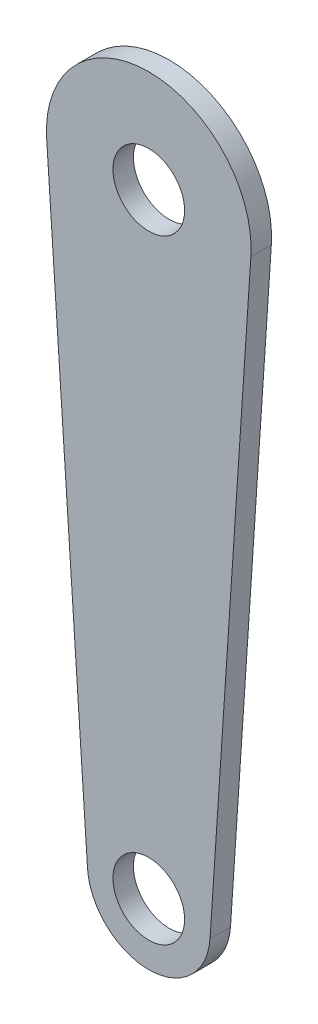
from build123d import *

# Parameters (mm, degrees)
SKETCH1_R      = 1.75
EXTRUDE1_DEPTH = 1


with BuildPart() as part:
    # Sketch1 → Extrude1 (new body)
    with BuildSketch(Plane.XY):
        with BuildLine():
            Line((-4.988876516, 29.666666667), (-2.993325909, -0.2))
            ThreePointArc((-2.993325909, -0.2), (0, -3), (2.993325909, -0.2))
            Line((2.993325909, -0.2), (4.988876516, 29.666666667))
            ThreePointArc((4.988876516, 29.666666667), (0, 35), (-4.988876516, 29.666666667))
        make_face()
        with Locations((0, 30)):
            Circle(SKETCH1_R, mode=Mode.SUBTRACT)
        Circle(SKETCH1_R, mode=Mode.SUBTRACT)
    extrude(amount=EXTRUDE1_DEPTH)


solid = part.part
